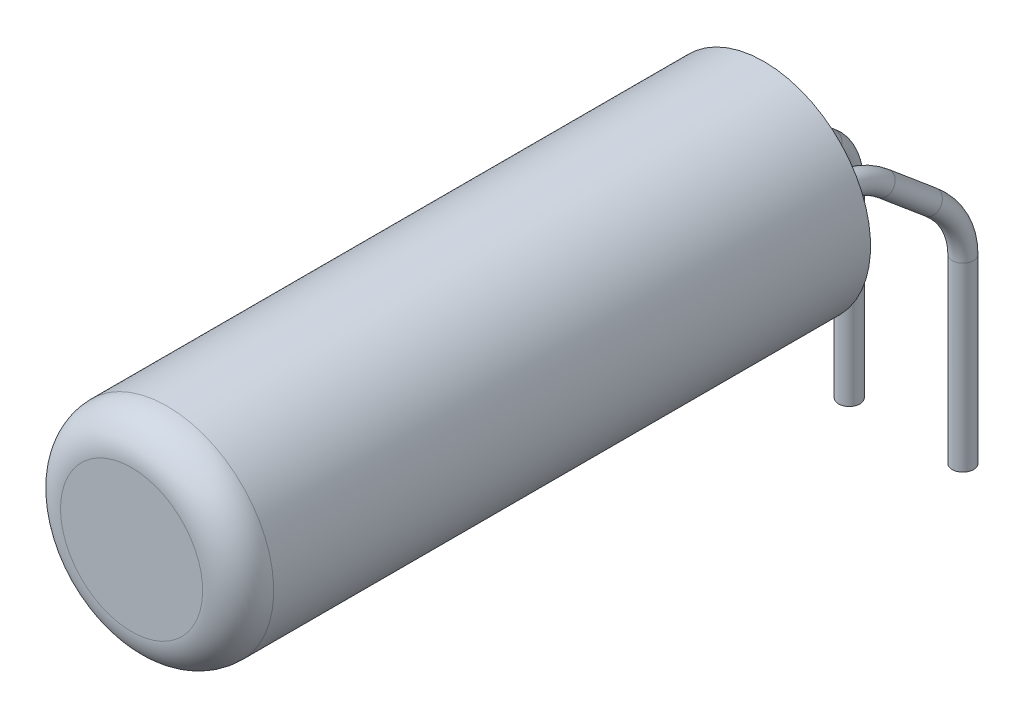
ISO-10303-21;
HEADER;
FILE_DESCRIPTION(('STEP AP214'),'2;1');
FILE_NAME('part.step','',(''),(''),'','','');
FILE_SCHEMA(('AUTOMOTIVE_DESIGN { 1 0 10303 214 1 1 1 1 }'));
ENDSEC;
DATA;
#1=APPLICATION_CONTEXT('core data for automotive mechanical design processes');
#2=APPLICATION_PROTOCOL_DEFINITION('international standard','automotive_design',2000,#1);
#3=PRODUCT_CONTEXT('',#1,'mechanical');
#4=PRODUCT('Part','Part','',(#3));
#5=PRODUCT_RELATED_PRODUCT_CATEGORY('part','',(#4));
#6=PRODUCT_DEFINITION_FORMATION('','',#4);
#7=PRODUCT_DEFINITION_CONTEXT('part definition',#1,'design');
#8=PRODUCT_DEFINITION('design','',#6,#7);
#9=PRODUCT_DEFINITION_SHAPE('','',#8);
#10=(LENGTH_UNIT() NAMED_UNIT(*) SI_UNIT(.MILLI.,.METRE.));
#11=(NAMED_UNIT(*) PLANE_ANGLE_UNIT() SI_UNIT($,.RADIAN.));
#12=(NAMED_UNIT(*) SI_UNIT($,.STERADIAN.) SOLID_ANGLE_UNIT());
#13=UNCERTAINTY_MEASURE_WITH_UNIT(LENGTH_MEASURE(1.E-05),#10,'distance_accuracy_value','');
#14=(GEOMETRIC_REPRESENTATION_CONTEXT(3) GLOBAL_UNCERTAINTY_ASSIGNED_CONTEXT((#13)) GLOBAL_UNIT_ASSIGNED_CONTEXT((#10,
#11,#12)) REPRESENTATION_CONTEXT('',''));
#15=CARTESIAN_POINT('',(0.,0.,0.));
#16=DIRECTION('',(0.,0.,1.));
#17=DIRECTION('',(1.,0.,0.));
#18=AXIS2_PLACEMENT_3D('',#15,#16,#17);
#19=CARTESIAN_POINT('',(0.,0.2,2.2));
#20=DIRECTION('',(0.,0.,1.));
#21=DIRECTION('',(0.,-1.,0.));
#22=AXIS2_PLACEMENT_3D('',#19,#20,#21);
#23=PLANE('',#22);
#24=CARTESIAN_POINT('',(-0.55,1.5,2.2));
#25=DIRECTION('',(0.,0.,1.));
#26=DIRECTION('',(0.,1.,0.));
#27=AXIS2_PLACEMENT_3D('',#24,#25,#26);
#28=CIRCLE('',#27,0.15);
#29=CARTESIAN_POINT('',(-0.55,1.65,2.2));
#30=VERTEX_POINT('',#29);
#31=EDGE_CURVE('E104',#30,#30,#28,.T.);
#32=ORIENTED_EDGE('',*,*,#31,.T.);
#33=EDGE_LOOP('',(#32));
#34=FACE_BOUND('',#33,.T.);
#35=CARTESIAN_POINT('',(0.,1.5,2.2));
#36=DIRECTION('',(0.,0.,-1.));
#37=DIRECTION('',(0.,1.,0.));
#38=AXIS2_PLACEMENT_3D('',#35,#36,#37);
#39=CIRCLE('',#38,1.3);
#40=CARTESIAN_POINT('',(0.,2.8,2.2));
#41=VERTEX_POINT('',#40);
#42=EDGE_CURVE('E63',#41,#41,#39,.T.);
#43=ORIENTED_EDGE('',*,*,#42,.T.);
#44=EDGE_LOOP('',(#43));
#45=FACE_BOUND('',#44,.T.);
#46=CARTESIAN_POINT('',(0.55,1.5,2.2));
#47=DIRECTION('',(0.,0.,1.));
#48=DIRECTION('',(0.,-1.,0.));
#49=AXIS2_PLACEMENT_3D('',#46,#47,#48);
#50=CIRCLE('',#49,0.15);
#51=CARTESIAN_POINT('',(0.55,1.35,2.2));
#52=VERTEX_POINT('',#51);
#53=EDGE_CURVE('E48',#52,#52,#50,.F.);
#54=ORIENTED_EDGE('',*,*,#53,.F.);
#55=EDGE_LOOP('',(#54));
#56=FACE_BOUND('',#55,.T.);
#57=ADVANCED_FACE('F34',(#34,#45,#56),#23,.F.);
#58=CARTESIAN_POINT('',(0.,0.,10.9));
#59=DIRECTION('',(0.,0.,-1.));
#60=DIRECTION('',(0.,1.,0.));
#61=AXIS2_PLACEMENT_3D('',#58,#59,#60);
#62=PLANE('',#61);
#63=CARTESIAN_POINT('',(0.,1.5,10.9));
#64=DIRECTION('',(0.,0.,-1.));
#65=DIRECTION('',(0.,1.,0.));
#66=AXIS2_PLACEMENT_3D('',#63,#64,#65);
#67=CIRCLE('',#66,1.);
#68=CARTESIAN_POINT('',(0.,2.5,10.9));
#69=VERTEX_POINT('',#68);
#70=EDGE_CURVE('E10',#69,#69,#67,.F.);
#71=ORIENTED_EDGE('',*,*,#70,.T.);
#72=EDGE_LOOP('',(#71));
#73=FACE_BOUND('',#72,.T.);
#74=ADVANCED_FACE('F148',(#73),#62,.F.);
#75=CARTESIAN_POINT('',(0.,1.5,2.2));
#76=DIRECTION('',(0.,0.,-1.));
#77=DIRECTION('',(0.,1.,0.));
#78=AXIS2_PLACEMENT_3D('',#75,#76,#77);
#79=CYLINDRICAL_SURFACE('',#78,1.5);
#80=CARTESIAN_POINT('',(0.,1.5,10.4));
#81=DIRECTION('',(0.,0.,-1.));
#82=DIRECTION('',(0.,1.,0.));
#83=AXIS2_PLACEMENT_3D('',#80,#81,#82);
#84=CIRCLE('',#83,1.5);
#85=CARTESIAN_POINT('',(0.,3.,10.4));
#86=VERTEX_POINT('',#85);
#87=EDGE_CURVE('E42',#86,#86,#84,.T.);
#88=ORIENTED_EDGE('',*,*,#87,.T.);
#89=EDGE_LOOP('',(#88));
#90=FACE_BOUND('',#89,.T.);
#91=CARTESIAN_POINT('',(0.,1.5,2.));
#92=DIRECTION('',(0.,0.,-1.));
#93=DIRECTION('',(0.,1.,0.));
#94=AXIS2_PLACEMENT_3D('',#91,#92,#93);
#95=CIRCLE('',#94,1.5);
#96=CARTESIAN_POINT('',(0.,3.,2.));
#97=VERTEX_POINT('',#96);
#98=EDGE_CURVE('E54',#97,#97,#95,.T.);
#99=ORIENTED_EDGE('',*,*,#98,.F.);
#100=EDGE_LOOP('',(#99));
#101=FACE_BOUND('',#100,.T.);
#102=ADVANCED_FACE('F153',(#90,#101),#79,.T.);
#103=CARTESIAN_POINT('',(0.,0.,2.));
#104=DIRECTION('',(0.,0.,1.));
#105=DIRECTION('',(0.,-1.,0.));
#106=AXIS2_PLACEMENT_3D('',#103,#104,#105);
#107=PLANE('',#106);
#108=CARTESIAN_POINT('',(0.,1.5,2.));
#109=DIRECTION('',(0.,0.,-1.));
#110=DIRECTION('',(0.,1.,0.));
#111=AXIS2_PLACEMENT_3D('',#108,#109,#110);
#112=CIRCLE('',#111,1.3);
#113=CARTESIAN_POINT('',(0.,2.8,2.));
#114=VERTEX_POINT('',#113);
#115=EDGE_CURVE('E60',#114,#114,#112,.T.);
#116=ORIENTED_EDGE('',*,*,#115,.F.);
#117=EDGE_LOOP('',(#116));
#118=FACE_BOUND('',#117,.T.);
#119=ORIENTED_EDGE('',*,*,#98,.T.);
#120=EDGE_LOOP('',(#119));
#121=FACE_BOUND('',#120,.T.);
#122=ADVANCED_FACE('F162',(#118,#121),#107,.F.);
#123=CARTESIAN_POINT('',(0.,1.5,2.2));
#124=DIRECTION('',(0.,0.,-1.));
#125=DIRECTION('',(0.,1.,0.));
#126=AXIS2_PLACEMENT_3D('',#123,#124,#125);
#127=CYLINDRICAL_SURFACE('',#126,1.3);
#128=ORIENTED_EDGE('',*,*,#42,.F.);
#129=EDGE_LOOP('',(#128));
#130=FACE_BOUND('',#129,.T.);
#131=ORIENTED_EDGE('',*,*,#115,.T.);
#132=EDGE_LOOP('',(#131));
#133=FACE_BOUND('',#132,.T.);
#134=ADVANCED_FACE('F159',(#130,#133),#127,.F.);
#135=CARTESIAN_POINT('',(0.8,0.0473186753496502,0.));
#136=DIRECTION('',(0.,-1.,0.));
#137=DIRECTION('',(1.,0.,0.));
#138=AXIS2_PLACEMENT_3D('',#135,#136,#137);
#139=CYLINDRICAL_SURFACE('',#138,0.15);
#140=CARTESIAN_POINT('',(0.8,0.0473186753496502,0.));
#141=DIRECTION('',(0.,-1.,0.));
#142=DIRECTION('',(0.13343828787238,0.,-0.991057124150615));
#143=AXIS2_PLACEMENT_3D('',#140,#141,#142);
#144=CIRCLE('',#143,0.15);
#145=CARTESIAN_POINT('',(0.8305931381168,0.0473186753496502,-0.14684706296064));
#146=VERTEX_POINT('',#145);
#147=EDGE_CURVE('E71',#146,#146,#144,.T.);
#148=ORIENTED_EDGE('',*,*,#147,.T.);
#149=EDGE_LOOP('',(#148));
#150=FACE_BOUND('',#149,.T.);
#151=CARTESIAN_POINT('',(0.8,-2.5,0.));
#152=DIRECTION('',(0.,-1.,0.));
#153=DIRECTION('',(0.13343828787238,0.,-0.991057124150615));
#154=AXIS2_PLACEMENT_3D('',#151,#152,#153);
#155=CIRCLE('',#154,0.15);
#156=CARTESIAN_POINT('',(0.820015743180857,-2.5,-0.148658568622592));
#157=VERTEX_POINT('',#156);
#158=EDGE_CURVE('E67',#157,#157,#155,.T.);
#159=ORIENTED_EDGE('',*,*,#158,.F.);
#160=EDGE_LOOP('',(#159));
#161=FACE_BOUND('',#160,.T.);
#162=ADVANCED_FACE('F157',(#150,#161),#139,.T.);
#163=CARTESIAN_POINT('',(0.596045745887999,0.0473186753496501,0.978980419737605));
#164=DIRECTION('',(-0.978980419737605,0.,-0.203954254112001));
#165=DIRECTION('',(-0.203954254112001,0.,0.978980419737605));
#166=AXIS2_PLACEMENT_3D('',#163,#164,#165);
#167=TOROIDAL_SURFACE('',#166,1.,0.15);
#168=CARTESIAN_POINT('',(0.722467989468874,0.832034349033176,0.372153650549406));
#169=DIRECTION('',(0.16004609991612,-0.619855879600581,-0.768221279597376));
#170=DIRECTION('',(0.0561046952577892,0.78270744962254,-0.619855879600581));
#171=AXIS2_PLACEMENT_3D('',#168,#169,#170);
#172=CIRCLE('',#171,0.15);
#173=CARTESIAN_POINT('',(0.741431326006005,0.949741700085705,0.281129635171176));
#174=VERTEX_POINT('',#173);
#175=EDGE_CURVE('E75',#174,#174,#172,.T.);
#176=CARTESIAN_POINT('',(0.596045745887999,0.0473186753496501,0.978980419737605));
#177=DIRECTION('',(-0.978980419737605,0.,-0.203954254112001));
#178=DIRECTION('',(-0.203954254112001,0.,0.978980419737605));
#179=AXIS2_PLACEMENT_3D('',#176,#177,#178);
#180=CIRCLE('',#179,1.15);
#181=EDGE_CURVE('',#174,#146,#180,.T.);
#182=ORIENTED_EDGE('',*,*,#175,.T.);
#183=ORIENTED_EDGE('',*,*,#147,.F.);
#184=ORIENTED_EDGE('',*,*,#181,.T.);
#185=ORIENTED_EDGE('',*,*,#181,.F.);
#186=EDGE_LOOP('',(#182,#184,#183,#185));
#187=FACE_BOUND('',#186,.T.);
#188=ADVANCED_FACE('F184',(#187),#167,.T.);
#189=CARTESIAN_POINT('',(0.607944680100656,1.27558121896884,0.921865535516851));
#190=DIRECTION('',(0.16004609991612,-0.619855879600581,-0.768221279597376));
#191=DIRECTION('',(0.,0.778253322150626,-0.62795044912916));
#192=AXIS2_PLACEMENT_3D('',#189,#190,#191);
#193=CYLINDRICAL_SURFACE('',#192,0.15);
#194=CARTESIAN_POINT('',(0.607944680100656,1.27558121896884,0.921865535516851));
#195=DIRECTION('',(0.16004609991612,-0.619855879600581,-0.768221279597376));
#196=DIRECTION('',(0.0561046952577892,0.78270744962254,-0.619855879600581));
#197=AXIS2_PLACEMENT_3D('',#194,#195,#196);
#198=CIRCLE('',#197,0.15);
#199=CARTESIAN_POINT('',(0.579136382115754,1.38715527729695,0.82583787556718));
#200=VERTEX_POINT('',#199);
#201=EDGE_CURVE('E79',#200,#200,#198,.T.);
#202=ORIENTED_EDGE('',*,*,#201,.T.);
#203=EDGE_LOOP('',(#202));
#204=FACE_BOUND('',#203,.T.);
#205=ORIENTED_EDGE('',*,*,#175,.F.);
#206=EDGE_LOOP('',(#205));
#207=FACE_BOUND('',#206,.T.);
#208=ADVANCED_FACE('F190',(#204,#207),#193,.T.);
#209=CARTESIAN_POINT('',(0.8,0.531754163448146,1.56204993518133));
#210=DIRECTION('',(-0.968245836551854,-0.25,0.));
#211=DIRECTION('',(0.25,-0.968245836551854,0.));
#212=AXIS2_PLACEMENT_3D('',#209,#210,#211);
#213=TOROIDAL_SURFACE('',#212,1.,0.15);
#214=CARTESIAN_POINT('',(0.55,1.5,1.56204993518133));
#215=DIRECTION('',(0.,0.,-1.));
#216=DIRECTION('',(0.,1.,0.));
#217=AXIS2_PLACEMENT_3D('',#214,#215,#216);
#218=CIRCLE('',#217,0.15);
#219=CARTESIAN_POINT('',(0.5125,1.64523687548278,1.56204993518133));
#220=VERTEX_POINT('',#219);
#221=EDGE_CURVE('E83',#220,#220,#218,.T.);
#222=CARTESIAN_POINT('',(0.8,0.531754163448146,1.56204993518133));
#223=DIRECTION('',(-0.968245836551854,-0.25,0.));
#224=DIRECTION('',(0.25,-0.968245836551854,0.));
#225=AXIS2_PLACEMENT_3D('',#222,#223,#224);
#226=CIRCLE('',#225,1.15);
#227=EDGE_CURVE('',#220,#200,#226,.T.);
#228=ORIENTED_EDGE('',*,*,#221,.T.);
#229=ORIENTED_EDGE('',*,*,#201,.F.);
#230=ORIENTED_EDGE('',*,*,#227,.T.);
#231=ORIENTED_EDGE('',*,*,#227,.F.);
#232=EDGE_LOOP('',(#228,#230,#229,#231));
#233=FACE_BOUND('',#232,.T.);
#234=ADVANCED_FACE('F196',(#233),#213,.T.);
#235=CARTESIAN_POINT('',(0.55,1.5,1.56204993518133));
#236=DIRECTION('',(0.,0.,1.));
#237=DIRECTION('',(1.,0.,0.));
#238=AXIS2_PLACEMENT_3D('',#235,#236,#237);
#239=CYLINDRICAL_SURFACE('',#238,0.15);
#240=ORIENTED_EDGE('',*,*,#221,.F.);
#241=EDGE_LOOP('',(#240));
#242=FACE_BOUND('',#241,.T.);
#243=ORIENTED_EDGE('',*,*,#53,.T.);
#244=EDGE_LOOP('',(#243));
#245=FACE_BOUND('',#244,.T.);
#246=ADVANCED_FACE('F203',(#242,#245),#239,.T.);
#247=CARTESIAN_POINT('',(0.8,-2.5,0.));
#248=DIRECTION('',(0.,-1.,0.));
#249=DIRECTION('',(0.13343828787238,0.,-0.991057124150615));
#250=AXIS2_PLACEMENT_3D('',#247,#248,#249);
#251=PLANE('',#250);
#252=ORIENTED_EDGE('',*,*,#158,.T.);
#253=EDGE_LOOP('',(#252));
#254=FACE_BOUND('',#253,.T.);
#255=ADVANCED_FACE('F135',(#254),#251,.T.);
#256=CARTESIAN_POINT('',(-0.8,0.0473186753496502,0.));
#257=DIRECTION('',(0.,-1.,0.));
#258=DIRECTION('',(1.,0.,0.));
#259=AXIS2_PLACEMENT_3D('',#256,#257,#258);
#260=CYLINDRICAL_SURFACE('',#259,0.15);
#261=CARTESIAN_POINT('',(-0.8,0.0473186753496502,0.));
#262=DIRECTION('',(0.,1.,0.));
#263=DIRECTION('',(-0.13343828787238,0.,-0.991057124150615));
#264=AXIS2_PLACEMENT_3D('',#261,#262,#263);
#265=CIRCLE('',#264,0.15);
#266=CARTESIAN_POINT('',(-0.8305931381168,0.0473186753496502,-0.14684706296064));
#267=VERTEX_POINT('',#266);
#268=EDGE_CURVE('E91',#267,#267,#265,.T.);
#269=ORIENTED_EDGE('',*,*,#268,.F.);
#270=EDGE_LOOP('',(#269));
#271=FACE_BOUND('',#270,.T.);
#272=CARTESIAN_POINT('',(-0.8,-2.5,0.));
#273=DIRECTION('',(0.,1.,0.));
#274=DIRECTION('',(-0.13343828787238,0.,-0.991057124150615));
#275=AXIS2_PLACEMENT_3D('',#272,#273,#274);
#276=CIRCLE('',#275,0.15);
#277=CARTESIAN_POINT('',(-0.820015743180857,-2.5,-0.148658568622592));
#278=VERTEX_POINT('',#277);
#279=EDGE_CURVE('E87',#278,#278,#276,.T.);
#280=ORIENTED_EDGE('',*,*,#279,.T.);
#281=EDGE_LOOP('',(#280));
#282=FACE_BOUND('',#281,.T.);
#283=ADVANCED_FACE('F129',(#271,#282),#260,.T.);
#284=CARTESIAN_POINT('',(-0.596045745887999,0.0473186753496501,0.978980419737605));
#285=DIRECTION('',(-0.978980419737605,0.,0.203954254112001));
#286=DIRECTION('',(0.203954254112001,0.,0.978980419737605));
#287=AXIS2_PLACEMENT_3D('',#284,#285,#286);
#288=TOROIDAL_SURFACE('',#287,1.,0.15);
#289=CARTESIAN_POINT('',(-0.722467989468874,0.832034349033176,0.372153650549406));
#290=DIRECTION('',(0.16004609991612,0.619855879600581,0.768221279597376));
#291=DIRECTION('',(-0.0561046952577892,0.78270744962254,-0.619855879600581));
#292=AXIS2_PLACEMENT_3D('',#289,#290,#291);
#293=CIRCLE('',#292,0.15);
#294=CARTESIAN_POINT('',(-0.741431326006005,0.949741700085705,0.281129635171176));
#295=VERTEX_POINT('',#294);
#296=EDGE_CURVE('E95',#295,#295,#293,.T.);
#297=CARTESIAN_POINT('',(-0.596045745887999,0.0473186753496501,0.978980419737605));
#298=DIRECTION('',(-0.978980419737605,0.,0.203954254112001));
#299=DIRECTION('',(0.203954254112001,0.,0.978980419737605));
#300=AXIS2_PLACEMENT_3D('',#297,#298,#299);
#301=CIRCLE('',#300,1.15);
#302=EDGE_CURVE('',#295,#267,#301,.T.);
#303=ORIENTED_EDGE('',*,*,#296,.F.);
#304=ORIENTED_EDGE('',*,*,#268,.T.);
#305=ORIENTED_EDGE('',*,*,#302,.T.);
#306=ORIENTED_EDGE('',*,*,#302,.F.);
#307=EDGE_LOOP('',(#303,#305,#304,#306));
#308=FACE_BOUND('',#307,.T.);
#309=ADVANCED_FACE('F123',(#308),#288,.T.);
#310=CARTESIAN_POINT('',(-0.607944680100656,1.27558121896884,0.921865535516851));
#311=DIRECTION('',(-0.16004609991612,-0.619855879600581,-0.768221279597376));
#312=DIRECTION('',(0.,0.778253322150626,-0.62795044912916));
#313=AXIS2_PLACEMENT_3D('',#310,#311,#312);
#314=CYLINDRICAL_SURFACE('',#313,0.15);
#315=CARTESIAN_POINT('',(-0.607944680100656,1.27558121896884,0.921865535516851));
#316=DIRECTION('',(0.16004609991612,0.619855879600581,0.768221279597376));
#317=DIRECTION('',(-0.0561046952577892,0.78270744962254,-0.619855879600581));
#318=AXIS2_PLACEMENT_3D('',#315,#316,#317);
#319=CIRCLE('',#318,0.15);
#320=CARTESIAN_POINT('',(-0.579136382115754,1.38715527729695,0.82583787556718));
#321=VERTEX_POINT('',#320);
#322=EDGE_CURVE('E99',#321,#321,#319,.T.);
#323=ORIENTED_EDGE('',*,*,#322,.F.);
#324=EDGE_LOOP('',(#323));
#325=FACE_BOUND('',#324,.T.);
#326=ORIENTED_EDGE('',*,*,#296,.T.);
#327=EDGE_LOOP('',(#326));
#328=FACE_BOUND('',#327,.T.);
#329=ADVANCED_FACE('F117',(#325,#328),#314,.T.);
#330=CARTESIAN_POINT('',(-0.8,0.531754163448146,1.56204993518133));
#331=DIRECTION('',(-0.968245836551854,0.25,0.));
#332=DIRECTION('',(-0.25,-0.968245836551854,0.));
#333=AXIS2_PLACEMENT_3D('',#330,#331,#332);
#334=TOROIDAL_SURFACE('',#333,1.,0.15);
#335=CARTESIAN_POINT('',(-0.55,1.5,1.56204993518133));
#336=DIRECTION('',(0.,0.,1.));
#337=DIRECTION('',(0.,1.,0.));
#338=AXIS2_PLACEMENT_3D('',#335,#336,#337);
#339=CIRCLE('',#338,0.15);
#340=CARTESIAN_POINT('',(-0.5125,1.64523687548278,1.56204993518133));
#341=VERTEX_POINT('',#340);
#342=EDGE_CURVE('E103',#341,#341,#339,.T.);
#343=CARTESIAN_POINT('',(-0.8,0.531754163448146,1.56204993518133));
#344=DIRECTION('',(-0.968245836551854,0.25,0.));
#345=DIRECTION('',(-0.25,-0.968245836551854,0.));
#346=AXIS2_PLACEMENT_3D('',#343,#344,#345);
#347=CIRCLE('',#346,1.15);
#348=EDGE_CURVE('',#341,#321,#347,.T.);
#349=ORIENTED_EDGE('',*,*,#342,.F.);
#350=ORIENTED_EDGE('',*,*,#322,.T.);
#351=ORIENTED_EDGE('',*,*,#348,.T.);
#352=ORIENTED_EDGE('',*,*,#348,.F.);
#353=EDGE_LOOP('',(#349,#351,#350,#352));
#354=FACE_BOUND('',#353,.T.);
#355=ADVANCED_FACE('F114',(#354),#334,.T.);
#356=CARTESIAN_POINT('',(-0.55,1.5,1.56204993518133));
#357=DIRECTION('',(0.,0.,1.));
#358=DIRECTION('',(1.,0.,0.));
#359=AXIS2_PLACEMENT_3D('',#356,#357,#358);
#360=CYLINDRICAL_SURFACE('',#359,0.15);
#361=ORIENTED_EDGE('',*,*,#342,.T.);
#362=EDGE_LOOP('',(#361));
#363=FACE_BOUND('',#362,.T.);
#364=ORIENTED_EDGE('',*,*,#31,.F.);
#365=EDGE_LOOP('',(#364));
#366=FACE_BOUND('',#365,.T.);
#367=ADVANCED_FACE('F111',(#363,#366),#360,.T.);
#368=CARTESIAN_POINT('',(-0.8,-2.5,0.));
#369=DIRECTION('',(0.,-1.,0.));
#370=DIRECTION('',(-0.13343828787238,0.,-0.991057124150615));
#371=AXIS2_PLACEMENT_3D('',#368,#369,#370);
#372=PLANE('',#371);
#373=ORIENTED_EDGE('',*,*,#279,.F.);
#374=EDGE_LOOP('',(#373));
#375=FACE_BOUND('',#374,.T.);
#376=ADVANCED_FACE('F139',(#375),#372,.T.);
#377=CARTESIAN_POINT('',(0.,1.5,10.4));
#378=DIRECTION('',(0.,0.,-1.));
#379=DIRECTION('',(0.,1.,0.));
#380=AXIS2_PLACEMENT_3D('',#377,#378,#379);
#381=TOROIDAL_SURFACE('',#380,1.,0.5);
#382=ORIENTED_EDGE('',*,*,#70,.F.);
#383=EDGE_LOOP('',(#382));
#384=FACE_BOUND('',#383,.T.);
#385=ORIENTED_EDGE('',*,*,#87,.F.);
#386=EDGE_LOOP('',(#385));
#387=FACE_BOUND('',#386,.T.);
#388=ADVANCED_FACE('F36',(#384,#387),#381,.T.);
#389=CLOSED_SHELL('',(#57,#74,#102,#122,#134,#162,#188,#208,#234,#246,#255,#283,#309,#329,#355,
#367,#376,#388));
#390=MANIFOLD_SOLID_BREP('B2',#389);
#391=ADVANCED_BREP_SHAPE_REPRESENTATION('',(#18,#390),#14);
#392=SHAPE_DEFINITION_REPRESENTATION(#9,#391);
ENDSEC;
END-ISO-10303-21;
